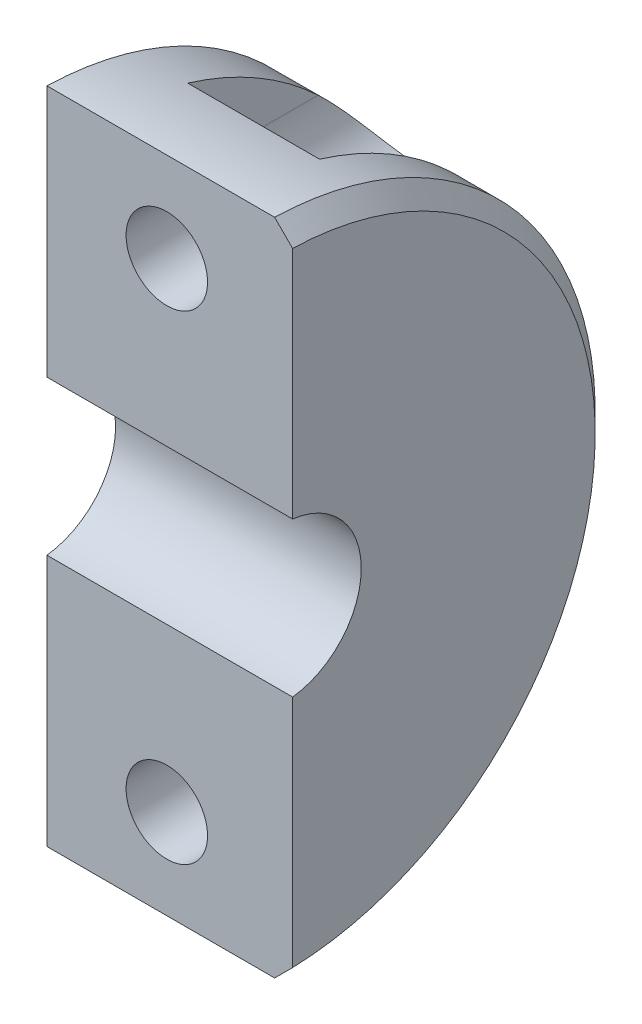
ISO-10303-21;
HEADER;
FILE_DESCRIPTION(('STEP AP214'),'2;1');
FILE_NAME('part.step','',(''),(''),'','','');
FILE_SCHEMA(('AUTOMOTIVE_DESIGN { 1 0 10303 214 1 1 1 1 }'));
ENDSEC;
DATA;
#1=APPLICATION_CONTEXT('core data for automotive mechanical design processes');
#2=APPLICATION_PROTOCOL_DEFINITION('international standard','automotive_design',2000,#1);
#3=PRODUCT_CONTEXT('',#1,'mechanical');
#4=PRODUCT('Part','Part','',(#3));
#5=PRODUCT_RELATED_PRODUCT_CATEGORY('part','',(#4));
#6=PRODUCT_DEFINITION_FORMATION('','',#4);
#7=PRODUCT_DEFINITION_CONTEXT('part definition',#1,'design');
#8=PRODUCT_DEFINITION('design','',#6,#7);
#9=PRODUCT_DEFINITION_SHAPE('','',#8);
#10=(LENGTH_UNIT() NAMED_UNIT(*) SI_UNIT(.MILLI.,.METRE.));
#11=(NAMED_UNIT(*) PLANE_ANGLE_UNIT() SI_UNIT($,.RADIAN.));
#12=(NAMED_UNIT(*) SI_UNIT($,.STERADIAN.) SOLID_ANGLE_UNIT());
#13=UNCERTAINTY_MEASURE_WITH_UNIT(LENGTH_MEASURE(1.E-05),#10,'distance_accuracy_value','');
#14=(GEOMETRIC_REPRESENTATION_CONTEXT(3) GLOBAL_UNCERTAINTY_ASSIGNED_CONTEXT((#13)) GLOBAL_UNIT_ASSIGNED_CONTEXT((#10,
#11,#12)) REPRESENTATION_CONTEXT('',''));
#15=CARTESIAN_POINT('',(0.,0.,0.));
#16=DIRECTION('',(0.,0.,1.));
#17=DIRECTION('',(1.,0.,0.));
#18=AXIS2_PLACEMENT_3D('',#15,#16,#17);
#19=CARTESIAN_POINT('',(46.,0.,0.));
#20=DIRECTION('',(1.,0.,0.));
#21=DIRECTION('',(0.,0.,-1.));
#22=AXIS2_PLACEMENT_3D('',#19,#20,#21);
#23=PLANE('',#22);
#24=DIRECTION('',(0.,1.,0.));
#25=VECTOR('',#24,1.);
#26=CARTESIAN_POINT('',(46.,-16.00282098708,-0.75));
#27=LINE('',#26,#25);
#28=CARTESIAN_POINT('',(46.,6.43343057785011,-0.75));
#29=VERTEX_POINT('',#28);
#30=CARTESIAN_POINT('',(45.9999999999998,25.9891804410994,-0.75));
#31=VERTEX_POINT('',#30);
#32=EDGE_CURVE('E96',#29,#31,#27,.T.);
#33=ORIENTED_EDGE('',*,*,#32,.F.);
#34=CARTESIAN_POINT('',(46.,0.,-1.25373862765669E-11));
#35=DIRECTION('',(-1.,0.,0.));
#36=DIRECTION('',(0.,0.,1.));
#37=AXIS2_PLACEMENT_3D('',#34,#35,#36);
#38=CIRCLE('',#37,6.477);
#39=CARTESIAN_POINT('',(46.,-6.43343057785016,-0.75));
#40=VERTEX_POINT('',#39);
#41=EDGE_CURVE('E19',#29,#40,#38,.T.);
#42=ORIENTED_EDGE('',*,*,#41,.T.);
#43=DIRECTION('',(0.,1.,0.));
#44=VECTOR('',#43,1.);
#45=CARTESIAN_POINT('',(46.,-16.00282098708,-0.75));
#46=LINE('',#45,#44);
#47=CARTESIAN_POINT('',(46.0000000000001,-25.9891804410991,-0.75));
#48=VERTEX_POINT('',#47);
#49=EDGE_CURVE('E125',#48,#40,#46,.T.);
#50=ORIENTED_EDGE('',*,*,#49,.F.);
#51=CARTESIAN_POINT('',(46.0000000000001,0.,0.));
#52=DIRECTION('',(-1.,0.,0.));
#53=DIRECTION('',(0.,0.,1.));
#54=AXIS2_PLACEMENT_3D('',#51,#52,#53);
#55=CIRCLE('',#54,26.0000000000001);
#56=EDGE_CURVE('E100',#31,#48,#55,.T.);
#57=ORIENTED_EDGE('',*,*,#56,.F.);
#58=EDGE_LOOP('',(#33,#42,#50,#57));
#59=FACE_BOUND('',#58,.T.);
#60=ADVANCED_FACE('F16',(#59),#23,.T.);
#61=CARTESIAN_POINT('',(-30.6,0.,-1.091393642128E-11));
#62=DIRECTION('',(-1.,0.,0.));
#63=DIRECTION('',(0.,0.,1.));
#64=AXIS2_PLACEMENT_3D('',#61,#62,#63);
#65=CYLINDRICAL_SURFACE('',#64,6.477);
#66=CARTESIAN_POINT('',(25.5,0.,-1.21029120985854E-11));
#67=DIRECTION('',(-1.,0.,0.));
#68=DIRECTION('',(0.,0.,1.));
#69=AXIS2_PLACEMENT_3D('',#66,#67,#68);
#70=CIRCLE('',#69,6.477);
#71=CARTESIAN_POINT('',(25.5,6.43343057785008,-0.75));
#72=VERTEX_POINT('',#71);
#73=CARTESIAN_POINT('',(25.5,-6.43343057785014,-0.75));
#74=VERTEX_POINT('',#73);
#75=EDGE_CURVE('E212',#72,#74,#70,.T.);
#76=ORIENTED_EDGE('',*,*,#75,.T.);
#77=DIRECTION('',(1.,0.,0.));
#78=VECTOR('',#77,1.);
#79=CARTESIAN_POINT('',(63.49656956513,-6.43343057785,-0.75));
#80=LINE('',#79,#78);
#81=EDGE_CURVE('E110',#40,#74,#80,.F.);
#82=ORIENTED_EDGE('',*,*,#81,.F.);
#83=ORIENTED_EDGE('',*,*,#41,.F.);
#84=DIRECTION('',(1.,0.,0.));
#85=VECTOR('',#84,1.);
#86=CARTESIAN_POINT('',(63.49656956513,6.43343057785,-0.75));
#87=LINE('',#86,#85);
#88=EDGE_CURVE('E104',#72,#29,#87,.T.);
#89=ORIENTED_EDGE('',*,*,#88,.F.);
#90=EDGE_LOOP('',(#76,#82,#83,#89));
#91=FACE_BOUND('',#90,.T.);
#92=ADVANCED_FACE('F107',(#91),#65,.F.);
#93=CARTESIAN_POINT('',(35.5,20.,8.866652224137));
#94=DIRECTION('',(0.,0.,-1.));
#95=DIRECTION('',(-1.,0.,0.));
#96=AXIS2_PLACEMENT_3D('',#93,#94,#95);
#97=CYLINDRICAL_SURFACE('',#96,3.4);
#98=CARTESIAN_POINT('',(35.5,20.,-8.));
#99=DIRECTION('',(0.,0.,-1.));
#100=DIRECTION('',(-1.,0.,0.));
#101=AXIS2_PLACEMENT_3D('',#98,#99,#100);
#102=CIRCLE('',#101,3.4);
#103=CARTESIAN_POINT('',(32.1,20.,-8.));
#104=VERTEX_POINT('',#103);
#105=EDGE_CURVE('E200',#104,#104,#102,.T.);
#106=ORIENTED_EDGE('',*,*,#105,.T.);
#107=EDGE_LOOP('',(#106));
#108=FACE_BOUND('',#107,.T.);
#109=CARTESIAN_POINT('',(35.5,20.,-0.750000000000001));
#110=DIRECTION('',(0.,0.,-1.));
#111=DIRECTION('',(-1.,0.,0.));
#112=AXIS2_PLACEMENT_3D('',#109,#110,#111);
#113=CIRCLE('',#112,3.4);
#114=CARTESIAN_POINT('',(32.1,20.,-0.750000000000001));
#115=VERTEX_POINT('',#114);
#116=EDGE_CURVE('E116',#115,#115,#113,.T.);
#117=ORIENTED_EDGE('',*,*,#116,.F.);
#118=EDGE_LOOP('',(#117));
#119=FACE_BOUND('',#118,.T.);
#120=ADVANCED_FACE('F263',(#108,#119),#97,.F.);
#121=CARTESIAN_POINT('',(35.5,-20.,8.866652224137));
#122=DIRECTION('',(0.,0.,-1.));
#123=DIRECTION('',(-1.,0.,0.));
#124=AXIS2_PLACEMENT_3D('',#121,#122,#123);
#125=CYLINDRICAL_SURFACE('',#124,3.4);
#126=CARTESIAN_POINT('',(35.5,-20.,-8.));
#127=DIRECTION('',(0.,0.,-1.));
#128=DIRECTION('',(-1.,0.,0.));
#129=AXIS2_PLACEMENT_3D('',#126,#127,#128);
#130=CIRCLE('',#129,3.4);
#131=CARTESIAN_POINT('',(32.1,-20.,-8.));
#132=VERTEX_POINT('',#131);
#133=EDGE_CURVE('E186',#132,#132,#130,.T.);
#134=ORIENTED_EDGE('',*,*,#133,.T.);
#135=EDGE_LOOP('',(#134));
#136=FACE_BOUND('',#135,.T.);
#137=CARTESIAN_POINT('',(35.5,-20.,-0.750000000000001));
#138=DIRECTION('',(0.,0.,-1.));
#139=DIRECTION('',(-1.,0.,0.));
#140=AXIS2_PLACEMENT_3D('',#137,#138,#139);
#141=CIRCLE('',#140,3.4);
#142=CARTESIAN_POINT('',(32.1,-20.,-0.750000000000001));
#143=VERTEX_POINT('',#142);
#144=EDGE_CURVE('E124',#143,#143,#141,.T.);
#145=ORIENTED_EDGE('',*,*,#144,.F.);
#146=EDGE_LOOP('',(#145));
#147=FACE_BOUND('',#146,.T.);
#148=ADVANCED_FACE('F259',(#136,#147),#125,.F.);
#149=CARTESIAN_POINT('',(63.49656956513,-16.00282098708,-0.75));
#150=DIRECTION('',(0.,0.,1.));
#151=DIRECTION('',(1.,0.,0.));
#152=AXIS2_PLACEMENT_3D('',#149,#150,#151);
#153=PLANE('',#152);
#154=ORIENTED_EDGE('',*,*,#116,.T.);
#155=EDGE_LOOP('',(#154));
#156=FACE_BOUND('',#155,.T.);
#157=DIRECTION('',(0.,1.,0.));
#158=VECTOR('',#157,1.);
#159=CARTESIAN_POINT('',(25.5,-30.70596061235,-0.75));
#160=LINE('',#159,#158);
#161=CARTESIAN_POINT('',(25.5,27.4897708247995,-0.749999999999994));
#162=VERTEX_POINT('',#161);
#163=EDGE_CURVE('E114',#162,#72,#160,.F.);
#164=ORIENTED_EDGE('',*,*,#163,.T.);
#165=ORIENTED_EDGE('',*,*,#88,.T.);
#166=ORIENTED_EDGE('',*,*,#32,.T.);
#167=CARTESIAN_POINT('',(44.4999999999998,27.4897708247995,-0.75));
#168=CARTESIAN_POINT('',(44.7500027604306,27.2396751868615,-0.75));
#169=CARTESIAN_POINT('',(45.0000041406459,26.9895781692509,-0.75));
#170=CARTESIAN_POINT('',(45.5000041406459,26.4893813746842,-0.75));
#171=CARTESIAN_POINT('',(45.7500027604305,26.2392815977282,-0.75));
#172=CARTESIAN_POINT('',(45.9999999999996,25.9891804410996,-0.75));
#173=B_SPLINE_CURVE_WITH_KNOTS('',3,(#167,#168,#169,#170,#171,#172),.UNSPECIFIED.,.F.,.F.,(4,2,
4),(0.,1.06086892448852,2.12173784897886),.UNSPECIFIED.);
#174=CARTESIAN_POINT('',(44.4999999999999,27.4897708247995,-0.749999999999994));
#175=VERTEX_POINT('',#174);
#176=EDGE_CURVE('E222',#175,#31,#173,.T.);
#177=ORIENTED_EDGE('',*,*,#176,.F.);
#178=DIRECTION('',(-1.,0.,0.));
#179=VECTOR('',#178,1.);
#180=CARTESIAN_POINT('',(46.,27.4897708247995,-0.749999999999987));
#181=LINE('',#180,#179);
#182=EDGE_CURVE('E121',#162,#175,#181,.F.);
#183=ORIENTED_EDGE('',*,*,#182,.F.);
#184=EDGE_LOOP('',(#164,#165,#166,#177,#183));
#185=FACE_BOUND('',#184,.T.);
#186=ADVANCED_FACE('F112',(#156,#185),#153,.T.);
#187=CARTESIAN_POINT('',(44.4999999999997,0.,0.));
#188=DIRECTION('',(-1.,0.,0.));
#189=DIRECTION('',(0.,0.,1.));
#190=AXIS2_PLACEMENT_3D('',#187,#188,#189);
#191=CONICAL_SURFACE('',#190,27.5000000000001,0.785398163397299);
#192=CARTESIAN_POINT('',(44.5,0.,0.));
#193=DIRECTION('',(-1.,0.,0.));
#194=DIRECTION('',(0.,0.,1.));
#195=AXIS2_PLACEMENT_3D('',#192,#193,#194);
#196=CIRCLE('',#195,27.5);
#197=CARTESIAN_POINT('',(44.4999999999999,-27.4897708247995,-0.749999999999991));
#198=VERTEX_POINT('',#197);
#199=EDGE_CURVE('E216',#175,#198,#196,.T.);
#200=ORIENTED_EDGE('',*,*,#199,.F.);
#201=ORIENTED_EDGE('',*,*,#176,.T.);
#202=ORIENTED_EDGE('',*,*,#56,.T.);
#203=CARTESIAN_POINT('',(44.4999999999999,-27.4897708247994,-0.75));
#204=CARTESIAN_POINT('',(44.7500027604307,-27.2396751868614,-0.75));
#205=CARTESIAN_POINT('',(45.000004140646,-26.9895781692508,-0.75));
#206=CARTESIAN_POINT('',(45.500004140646,-26.4893813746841,-0.75));
#207=CARTESIAN_POINT('',(45.7500027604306,-26.2392815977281,-0.75));
#208=CARTESIAN_POINT('',(45.9999999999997,-25.9891804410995,-0.75));
#209=B_SPLINE_CURVE_WITH_KNOTS('',3,(#203,#204,#205,#206,#207,#208),.UNSPECIFIED.,.F.,.F.,(4,2,
4),(0.,1.06086892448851,2.12173784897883),.UNSPECIFIED.);
#210=EDGE_CURVE('E126',#198,#48,#209,.T.);
#211=ORIENTED_EDGE('',*,*,#210,.F.);
#212=EDGE_LOOP('',(#200,#201,#202,#211));
#213=FACE_BOUND('',#212,.T.);
#214=ADVANCED_FACE('F225',(#213),#191,.T.);
#215=CARTESIAN_POINT('',(63.49656956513,-16.00282098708,-0.75));
#216=DIRECTION('',(0.,0.,1.));
#217=DIRECTION('',(1.,0.,0.));
#218=AXIS2_PLACEMENT_3D('',#215,#216,#217);
#219=PLANE('',#218);
#220=ORIENTED_EDGE('',*,*,#144,.T.);
#221=EDGE_LOOP('',(#220));
#222=FACE_BOUND('',#221,.T.);
#223=ORIENTED_EDGE('',*,*,#49,.T.);
#224=ORIENTED_EDGE('',*,*,#81,.T.);
#225=DIRECTION('',(0.,1.,0.));
#226=VECTOR('',#225,1.);
#227=CARTESIAN_POINT('',(25.5,-30.70596061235,-0.75));
#228=LINE('',#227,#226);
#229=CARTESIAN_POINT('',(25.5,-27.4897708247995,-0.749999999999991));
#230=VERTEX_POINT('',#229);
#231=EDGE_CURVE('E209',#74,#230,#228,.F.);
#232=ORIENTED_EDGE('',*,*,#231,.T.);
#233=DIRECTION('',(-1.,0.,0.));
#234=VECTOR('',#233,1.);
#235=CARTESIAN_POINT('',(46.,-27.4897708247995,-0.749999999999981));
#236=LINE('',#235,#234);
#237=EDGE_CURVE('E213',#198,#230,#236,.T.);
#238=ORIENTED_EDGE('',*,*,#237,.F.);
#239=ORIENTED_EDGE('',*,*,#210,.T.);
#240=EDGE_LOOP('',(#223,#224,#232,#238,#239));
#241=FACE_BOUND('',#240,.T.);
#242=ADVANCED_FACE('F230',(#222,#241),#219,.T.);
#243=CARTESIAN_POINT('',(25.5,-30.70596061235,0.));
#244=DIRECTION('',(1.,0.,0.));
#245=DIRECTION('',(0.,0.,-1.));
#246=AXIS2_PLACEMENT_3D('',#243,#244,#245);
#247=PLANE('',#246);
#248=CARTESIAN_POINT('',(25.5,0.,0.));
#249=DIRECTION('',(-1.,0.,0.));
#250=DIRECTION('',(0.,0.,1.));
#251=AXIS2_PLACEMENT_3D('',#248,#249,#250);
#252=CIRCLE('',#251,27.5);
#253=EDGE_CURVE('E182',#230,#162,#252,.F.);
#254=ORIENTED_EDGE('',*,*,#253,.F.);
#255=ORIENTED_EDGE('',*,*,#231,.F.);
#256=ORIENTED_EDGE('',*,*,#75,.F.);
#257=ORIENTED_EDGE('',*,*,#163,.F.);
#258=EDGE_LOOP('',(#254,#255,#256,#257));
#259=FACE_BOUND('',#258,.T.);
#260=ADVANCED_FACE('F233',(#259),#247,.F.);
#261=CARTESIAN_POINT('',(41.,26.52133436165,-27.5));
#262=DIRECTION('',(1.,0.,0.));
#263=DIRECTION('',(0.,0.,-1.));
#264=AXIS2_PLACEMENT_3D('',#261,#262,#263);
#265=PLANE('',#264);
#266=DIRECTION('',(0.,0.,1.));
#267=VECTOR('',#266,1.);
#268=CARTESIAN_POINT('',(41.,20.,-27.5));
#269=LINE('',#268,#267);
#270=CARTESIAN_POINT('',(41.,20.,-18.8745860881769));
#271=VERTEX_POINT('',#270);
#272=CARTESIAN_POINT('',(41.,20.,-8.));
#273=VERTEX_POINT('',#272);
#274=EDGE_CURVE('E196',#271,#273,#269,.T.);
#275=ORIENTED_EDGE('',*,*,#274,.T.);
#276=DIRECTION('',(0.,1.,0.));
#277=VECTOR('',#276,1.);
#278=CARTESIAN_POINT('',(41.,20.,-8.));
#279=LINE('',#278,#277);
#280=CARTESIAN_POINT('',(41.,26.3106442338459,-7.99999999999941));
#281=VERTEX_POINT('',#280);
#282=EDGE_CURVE('E206',#273,#281,#279,.T.);
#283=ORIENTED_EDGE('',*,*,#282,.T.);
#284=CARTESIAN_POINT('',(41.,0.,0.));
#285=DIRECTION('',(-1.,0.,0.));
#286=DIRECTION('',(0.,0.,1.));
#287=AXIS2_PLACEMENT_3D('',#284,#285,#286);
#288=CIRCLE('',#287,27.5);
#289=EDGE_CURVE('E205',#271,#281,#288,.F.);
#290=ORIENTED_EDGE('',*,*,#289,.F.);
#291=EDGE_LOOP('',(#275,#283,#290));
#292=FACE_BOUND('',#291,.T.);
#293=ADVANCED_FACE('F323',(#292),#265,.F.);
#294=CARTESIAN_POINT('',(35.5,20.,-8.));
#295=DIRECTION('',(0.,0.,1.));
#296=DIRECTION('',(1.,0.,0.));
#297=AXIS2_PLACEMENT_3D('',#294,#295,#296);
#298=PLANE('',#297);
#299=ORIENTED_EDGE('',*,*,#105,.F.);
#300=EDGE_LOOP('',(#299));
#301=FACE_BOUND('',#300,.T.);
#302=ORIENTED_EDGE('',*,*,#282,.F.);
#303=CARTESIAN_POINT('',(35.5,20.,-8.));
#304=DIRECTION('',(0.,0.,1.));
#305=DIRECTION('',(1.,0.,0.));
#306=AXIS2_PLACEMENT_3D('',#303,#304,#305);
#307=CIRCLE('',#306,5.5);
#308=CARTESIAN_POINT('',(30.,20.,-8.));
#309=VERTEX_POINT('',#308);
#310=EDGE_CURVE('E195',#273,#309,#307,.F.);
#311=ORIENTED_EDGE('',*,*,#310,.T.);
#312=DIRECTION('',(0.,1.,0.));
#313=VECTOR('',#312,1.);
#314=CARTESIAN_POINT('',(30.,20.,-8.));
#315=LINE('',#314,#313);
#316=CARTESIAN_POINT('',(30.,26.3106442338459,-7.99999999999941));
#317=VERTEX_POINT('',#316);
#318=EDGE_CURVE('E198',#309,#317,#315,.T.);
#319=ORIENTED_EDGE('',*,*,#318,.T.);
#320=DIRECTION('',(-1.,0.,0.));
#321=VECTOR('',#320,1.);
#322=CARTESIAN_POINT('',(46.,26.3106442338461,-7.99999999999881));
#323=LINE('',#322,#321);
#324=EDGE_CURVE('E201',#281,#317,#323,.T.);
#325=ORIENTED_EDGE('',*,*,#324,.F.);
#326=EDGE_LOOP('',(#302,#311,#319,#325));
#327=FACE_BOUND('',#326,.T.);
#328=ADVANCED_FACE('F331',(#301,#327),#298,.F.);
#329=CARTESIAN_POINT('',(30.,20.,-27.5));
#330=DIRECTION('',(-1.,0.,0.));
#331=DIRECTION('',(0.,0.,1.));
#332=AXIS2_PLACEMENT_3D('',#329,#330,#331);
#333=PLANE('',#332);
#334=ORIENTED_EDGE('',*,*,#318,.F.);
#335=DIRECTION('',(0.,0.,1.));
#336=VECTOR('',#335,1.);
#337=CARTESIAN_POINT('',(30.,20.,-27.5));
#338=LINE('',#337,#336);
#339=CARTESIAN_POINT('',(30.,19.9999999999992,-18.8745860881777));
#340=VERTEX_POINT('',#339);
#341=EDGE_CURVE('E193',#309,#340,#338,.F.);
#342=ORIENTED_EDGE('',*,*,#341,.T.);
#343=CARTESIAN_POINT('',(30.,0.,0.));
#344=DIRECTION('',(-1.,0.,0.));
#345=DIRECTION('',(0.,0.,1.));
#346=AXIS2_PLACEMENT_3D('',#343,#344,#345);
#347=CIRCLE('',#346,27.5);
#348=EDGE_CURVE('E204',#317,#340,#347,.T.);
#349=ORIENTED_EDGE('',*,*,#348,.F.);
#350=EDGE_LOOP('',(#334,#342,#349));
#351=FACE_BOUND('',#350,.T.);
#352=ADVANCED_FACE('F341',(#351),#333,.F.);
#353=CARTESIAN_POINT('',(35.5,20.,-27.5));
#354=DIRECTION('',(0.,0.,1.));
#355=DIRECTION('',(1.,0.,0.));
#356=AXIS2_PLACEMENT_3D('',#353,#354,#355);
#357=CYLINDRICAL_SURFACE('',#356,5.5);
#358=ORIENTED_EDGE('',*,*,#341,.F.);
#359=ORIENTED_EDGE('',*,*,#310,.F.);
#360=ORIENTED_EDGE('',*,*,#274,.F.);
#361=CARTESIAN_POINT('',(30.,19.9999999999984,-18.8745860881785));
#362=CARTESIAN_POINT('',(30.0000150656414,19.8413978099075,-19.042674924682));
#363=CARTESIAN_POINT('',(30.0068638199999,19.6805873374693,-19.2088004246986));
#364=CARTESIAN_POINT('',(30.0354704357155,19.3552748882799,-19.5365407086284));
#365=CARTESIAN_POINT('',(30.0572499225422,19.1907678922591,-19.69814859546));
#366=CARTESIAN_POINT('',(30.1172335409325,18.8577727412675,-20.0171955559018));
#367=CARTESIAN_POINT('',(30.1555826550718,18.6892621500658,-20.1745844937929));
#368=CARTESIAN_POINT('',(30.2500369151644,18.3511596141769,-20.4826062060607));
#369=CARTESIAN_POINT('',(30.3061317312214,18.1815683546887,-20.6332428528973));
#370=CARTESIAN_POINT('',(30.4242933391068,17.8767140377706,-20.8974956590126));
#371=CARTESIAN_POINT('',(30.4829476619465,17.7413387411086,-21.0125113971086));
#372=CARTESIAN_POINT('',(30.6130720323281,17.4720994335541,-21.2369119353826));
#373=CARTESIAN_POINT('',(30.6845394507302,17.3382351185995,-21.3462978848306));
#374=CARTESIAN_POINT('',(30.8405503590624,17.0737350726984,-21.5584373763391));
#375=CARTESIAN_POINT('',(30.9250502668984,16.9430902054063,-21.6612114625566));
#376=CARTESIAN_POINT('',(31.1076472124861,16.6860789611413,-21.859806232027));
#377=CARTESIAN_POINT('',(31.2057418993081,16.5597118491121,-21.9556281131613));
#378=CARTESIAN_POINT('',(31.3989964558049,16.3325288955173,-22.1249922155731));
#379=CARTESIAN_POINT('',(31.4921505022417,16.2308412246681,-22.1996565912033));
#380=CARTESIAN_POINT('',(31.6881069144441,16.032775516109,-22.3431209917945));
#381=CARTESIAN_POINT('',(31.7909075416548,15.9363965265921,-22.4119220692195));
#382=CARTESIAN_POINT('',(32.0060331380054,15.7500039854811,-22.5433003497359));
#383=CARTESIAN_POINT('',(32.1183658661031,15.6599957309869,-22.6058723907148));
#384=CARTESIAN_POINT('',(32.3520162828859,15.4876548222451,-22.7242926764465));
#385=CARTESIAN_POINT('',(32.4733294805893,15.4053183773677,-22.7801442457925));
#386=CARTESIAN_POINT('',(32.725208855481,15.2489316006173,-22.8851265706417));
#387=CARTESIAN_POINT('',(32.8558306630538,15.1749393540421,-22.9342106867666));
#388=CARTESIAN_POINT('',(33.1247195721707,15.0370514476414,-23.0248538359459));
#389=CARTESIAN_POINT('',(33.2629831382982,14.9731511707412,-23.066416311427));
#390=CARTESIAN_POINT('',(33.5461376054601,14.8564736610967,-23.141737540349));
#391=CARTESIAN_POINT('',(33.6910268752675,14.8036937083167,-23.1754982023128));
#392=CARTESIAN_POINT('',(33.9862303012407,14.7101544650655,-23.234983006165));
#393=CARTESIAN_POINT('',(34.136543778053,14.6693936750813,-23.2607081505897));
#394=CARTESIAN_POINT('',(34.4239524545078,14.6045104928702,-23.3014927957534));
#395=CARTESIAN_POINT('',(34.5606179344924,14.5790269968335,-23.3174299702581));
#396=CARTESIAN_POINT('',(34.8360778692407,14.5384450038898,-23.3427546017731));
#397=CARTESIAN_POINT('',(34.9748721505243,14.5233456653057,-23.3521425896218));
#398=CARTESIAN_POINT('',(35.2534475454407,14.503755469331,-23.3643148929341));
#399=CARTESIAN_POINT('',(35.3932283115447,14.4992610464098,-23.3671014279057));
#400=CARTESIAN_POINT('',(35.6727009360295,14.5009365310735,-23.3660617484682));
#401=CARTESIAN_POINT('',(35.8123927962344,14.507106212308,-23.3622356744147));
#402=CARTESIAN_POINT('',(36.0827907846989,14.5293767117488,-23.3483911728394));
#403=CARTESIAN_POINT('',(36.2135630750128,14.5449036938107,-23.3387304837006));
#404=CARTESIAN_POINT('',(36.4731541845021,14.5851843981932,-23.313578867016));
#405=CARTESIAN_POINT('',(36.6019723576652,14.6099411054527,-23.2980860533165));
#406=CARTESIAN_POINT('',(36.8566734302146,14.668349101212,-23.2613568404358));
#407=CARTESIAN_POINT('',(36.9825576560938,14.7019962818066,-23.2401230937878));
#408=CARTESIAN_POINT('',(37.2306848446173,14.7777816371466,-23.192006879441));
#409=CARTESIAN_POINT('',(37.3529264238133,14.8199229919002,-23.1651222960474));
#410=CARTESIAN_POINT('',(37.5946259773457,14.9128070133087,-23.1054381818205));
#411=CARTESIAN_POINT('',(37.714022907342,14.963659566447,-23.0725626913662));
#412=CARTESIAN_POINT('',(37.9476319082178,15.0729587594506,-23.0013079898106));
#413=CARTESIAN_POINT('',(38.0618420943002,15.1314081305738,-22.9629267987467));
#414=CARTESIAN_POINT('',(38.2844427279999,15.2552033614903,-22.8808714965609));
#415=CARTESIAN_POINT('',(38.3928341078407,15.3205481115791,-22.8371982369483));
#416=CARTESIAN_POINT('',(38.6033889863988,15.457450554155,-22.7447586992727));
#417=CARTESIAN_POINT('',(38.7055501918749,15.5290105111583,-22.6959905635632));
#418=CARTESIAN_POINT('',(38.9108255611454,15.6832901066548,-22.5896841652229));
#419=CARTESIAN_POINT('',(39.0134137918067,15.7664446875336,-22.5317603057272));
#420=CARTESIAN_POINT('',(39.2106288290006,15.9381826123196,-22.4106095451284));
#421=CARTESIAN_POINT('',(39.3052523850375,16.026768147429,-22.3473804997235));
#422=CARTESIAN_POINT('',(39.5768121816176,16.2992913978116,-22.1502392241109));
#423=CARTESIAN_POINT('',(39.7415979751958,16.4901184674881,-22.0087892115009));
#424=CARTESIAN_POINT('',(39.9935135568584,16.8238343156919,-21.7540481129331));
#425=CARTESIAN_POINT('',(40.0890863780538,16.9638582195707,-21.6451011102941));
#426=CARTESIAN_POINT('',(40.2646993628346,17.2476452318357,-21.4196528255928));
#427=CARTESIAN_POINT('',(40.3447341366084,17.3914096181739,-21.3031489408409));
#428=CARTESIAN_POINT('',(40.4900196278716,17.6813580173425,-21.0631226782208));
#429=CARTESIAN_POINT('',(40.5552228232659,17.8275482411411,-20.9395792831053));
#430=CARTESIAN_POINT('',(40.6712998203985,18.1205096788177,-20.6865799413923));
#431=CARTESIAN_POINT('',(40.7221716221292,18.267280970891,-20.5571231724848));
#432=CARTESIAN_POINT('',(40.8071353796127,18.5493526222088,-20.3028291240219));
#433=CARTESIAN_POINT('',(40.8421908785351,18.6846976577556,-20.1783595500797));
#434=CARTESIAN_POINT('',(40.901402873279,18.9541176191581,-19.925500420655));
#435=CARTESIAN_POINT('',(40.9255581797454,19.0881924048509,-19.7971104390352));
#436=CARTESIAN_POINT('',(40.9634774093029,19.3533131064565,-19.537996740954));
#437=CARTESIAN_POINT('',(40.9773268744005,19.4843750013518,-19.4073016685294));
#438=CARTESIAN_POINT('',(40.9955822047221,19.744089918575,-19.1430231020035));
#439=CARTESIAN_POINT('',(40.9999930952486,19.8727441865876,-19.0094411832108));
#440=CARTESIAN_POINT('',(41.,19.9999999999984,-18.8745860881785));
#441=B_SPLINE_CURVE_WITH_KNOTS('',3,(#361,#362,#363,#364,#365,#366,#367,#368,#369,#370,#371,
#372,#373,#374,#375,#376,#377,#378,#379,#380,#381,#382,#383,#384,#385,#386,#387,#388,#389,#390,
#391,#392,#393,#394,#395,#396,#397,#398,#399,#400,#401,#402,#403,#404,#405,#406,#407,#408,#409,
#410,#411,#412,#413,#414,#415,#416,#417,#418,#419,#420,#421,#422,#423,#424,#425,#426,#427,#428,
#429,#430,#431,#432,#433,#434,#435,#436,#437,#438,#439,#440),.UNSPECIFIED.,.F.,.F.,(4,2,2,2,2,2,
2,2,2,2,2,2,2,2,2,2,2,2,2,2,2,2,2,2,2,2,2,2,2,2,2,2,2,2,2,2,2,2,2,4),(0.,0.693321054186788,
1.38764843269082,2.08817820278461,2.78830093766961,3.34903406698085,3.9096522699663,
4.46843480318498,5.0271208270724,5.49712364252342,5.96704191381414,6.43734642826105,
6.90741731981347,7.38058116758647,7.85352791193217,8.32635883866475,8.79913074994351,
9.21838770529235,9.63761067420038,10.0566926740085,10.4757657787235,10.8714361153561,
11.2672345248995,11.6628503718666,12.0586146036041,12.459798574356,12.8611271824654,
13.2623913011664,13.6638022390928,14.0959473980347,14.5282680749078,15.3922599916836,
15.9961235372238,16.6001961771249,17.2061778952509,17.8122441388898,18.3734347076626,
18.9346864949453,19.4912260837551,20.0474692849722),.UNSPECIFIED.);
#442=EDGE_CURVE('E140',#340,#271,#441,.T.);
#443=ORIENTED_EDGE('',*,*,#442,.F.);
#444=EDGE_LOOP('',(#358,#359,#360,#443));
#445=FACE_BOUND('',#444,.T.);
#446=ADVANCED_FACE('F170',(#445),#357,.F.);
#447=CARTESIAN_POINT('',(35.5,-20.,-27.5));
#448=DIRECTION('',(0.,0.,1.));
#449=DIRECTION('',(1.,0.,0.));
#450=AXIS2_PLACEMENT_3D('',#447,#448,#449);
#451=CYLINDRICAL_SURFACE('',#450,5.5);
#452=DIRECTION('',(0.,0.,1.));
#453=VECTOR('',#452,1.);
#454=CARTESIAN_POINT('',(30.,-20.,-27.5));
#455=LINE('',#454,#453);
#456=CARTESIAN_POINT('',(30.,-20.,-8.));
#457=VERTEX_POINT('',#456);
#458=CARTESIAN_POINT('',(30.,-20.,-18.8745860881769));
#459=VERTEX_POINT('',#458);
#460=EDGE_CURVE('E173',#457,#459,#455,.F.);
#461=ORIENTED_EDGE('',*,*,#460,.T.);
#462=CARTESIAN_POINT('',(41.,-19.9999999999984,-18.8745860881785));
#463=CARTESIAN_POINT('',(40.9999849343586,-19.8413978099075,-19.042674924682));
#464=CARTESIAN_POINT('',(40.9931361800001,-19.6805873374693,-19.2088004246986));
#465=CARTESIAN_POINT('',(40.9645295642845,-19.3552748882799,-19.5365407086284));
#466=CARTESIAN_POINT('',(40.9427500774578,-19.1907678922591,-19.69814859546));
#467=CARTESIAN_POINT('',(40.8827664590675,-18.8577727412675,-20.0171955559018));
#468=CARTESIAN_POINT('',(40.8444173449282,-18.6892621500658,-20.1745844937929));
#469=CARTESIAN_POINT('',(40.7499630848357,-18.3511596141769,-20.4826062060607));
#470=CARTESIAN_POINT('',(40.6938682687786,-18.1815683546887,-20.6332428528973));
#471=CARTESIAN_POINT('',(40.5757066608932,-17.8767140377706,-20.8974956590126));
#472=CARTESIAN_POINT('',(40.5170523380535,-17.7413387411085,-21.0125113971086));
#473=CARTESIAN_POINT('',(40.386927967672,-17.4720994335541,-21.2369119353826));
#474=CARTESIAN_POINT('',(40.3154605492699,-17.3382351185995,-21.3462978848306));
#475=CARTESIAN_POINT('',(40.1594496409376,-17.0737350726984,-21.5584373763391));
#476=CARTESIAN_POINT('',(40.0749497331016,-16.9430902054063,-21.6612114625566));
#477=CARTESIAN_POINT('',(39.8923527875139,-16.6860789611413,-21.859806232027));
#478=CARTESIAN_POINT('',(39.7942581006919,-16.5597118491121,-21.9556281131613));
#479=CARTESIAN_POINT('',(39.6010035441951,-16.3325288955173,-22.1249922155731));
#480=CARTESIAN_POINT('',(39.5078494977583,-16.2308412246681,-22.1996565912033));
#481=CARTESIAN_POINT('',(39.3118930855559,-16.032775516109,-22.3431209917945));
#482=CARTESIAN_POINT('',(39.2090924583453,-15.9363965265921,-22.4119220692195));
#483=CARTESIAN_POINT('',(38.9939668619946,-15.7500039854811,-22.5433003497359));
#484=CARTESIAN_POINT('',(38.8816341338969,-15.6599957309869,-22.6058723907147));
#485=CARTESIAN_POINT('',(38.6479837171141,-15.4876548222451,-22.7242926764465));
#486=CARTESIAN_POINT('',(38.5266705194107,-15.4053183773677,-22.7801442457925));
#487=CARTESIAN_POINT('',(38.274791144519,-15.2489316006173,-22.8851265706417));
#488=CARTESIAN_POINT('',(38.1441693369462,-15.1749393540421,-22.9342106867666));
#489=CARTESIAN_POINT('',(37.8752804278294,-15.0370514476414,-23.0248538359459));
#490=CARTESIAN_POINT('',(37.7370168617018,-14.9731511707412,-23.066416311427));
#491=CARTESIAN_POINT('',(37.4538623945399,-14.8564736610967,-23.141737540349));
#492=CARTESIAN_POINT('',(37.3089731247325,-14.8036937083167,-23.1754982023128));
#493=CARTESIAN_POINT('',(37.0137696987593,-14.7101544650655,-23.234983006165));
#494=CARTESIAN_POINT('',(36.8634562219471,-14.6693936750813,-23.2607081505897));
#495=CARTESIAN_POINT('',(36.5760475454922,-14.6045104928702,-23.3014927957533));
#496=CARTESIAN_POINT('',(36.4393820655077,-14.5790269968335,-23.3174299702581));
#497=CARTESIAN_POINT('',(36.1639221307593,-14.5384450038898,-23.3427546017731));
#498=CARTESIAN_POINT('',(36.0251278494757,-14.5233456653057,-23.3521425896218));
#499=CARTESIAN_POINT('',(35.7465524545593,-14.503755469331,-23.3643148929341));
#500=CARTESIAN_POINT('',(35.6067716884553,-14.4992610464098,-23.3671014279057));
#501=CARTESIAN_POINT('',(35.3272990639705,-14.5009365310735,-23.3660617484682));
#502=CARTESIAN_POINT('',(35.1876072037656,-14.507106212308,-23.3622356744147));
#503=CARTESIAN_POINT('',(34.9172092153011,-14.5293767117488,-23.3483911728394));
#504=CARTESIAN_POINT('',(34.7864369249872,-14.5449036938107,-23.3387304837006));
#505=CARTESIAN_POINT('',(34.5268458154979,-14.5851843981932,-23.313578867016));
#506=CARTESIAN_POINT('',(34.3980276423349,-14.6099411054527,-23.2980860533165));
#507=CARTESIAN_POINT('',(34.1433265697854,-14.668349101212,-23.2613568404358));
#508=CARTESIAN_POINT('',(34.0174423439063,-14.7019962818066,-23.2401230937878));
#509=CARTESIAN_POINT('',(33.7693151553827,-14.7777816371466,-23.192006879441));
#510=CARTESIAN_POINT('',(33.6470735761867,-14.8199229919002,-23.1651222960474));
#511=CARTESIAN_POINT('',(33.4053740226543,-14.9128070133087,-23.1054381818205));
#512=CARTESIAN_POINT('',(33.285977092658,-14.963659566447,-23.0725626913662));
#513=CARTESIAN_POINT('',(33.0523680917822,-15.0729587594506,-23.0013079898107));
#514=CARTESIAN_POINT('',(32.9381579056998,-15.1314081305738,-22.9629267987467));
#515=CARTESIAN_POINT('',(32.7155572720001,-15.2552033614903,-22.8808714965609));
#516=CARTESIAN_POINT('',(32.6071658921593,-15.3205481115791,-22.8371982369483));
#517=CARTESIAN_POINT('',(32.3966110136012,-15.457450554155,-22.7447586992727));
#518=CARTESIAN_POINT('',(32.2944498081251,-15.5290105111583,-22.6959905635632));
#519=CARTESIAN_POINT('',(32.0891744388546,-15.6832901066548,-22.5896841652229));
#520=CARTESIAN_POINT('',(31.9865862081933,-15.7664446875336,-22.5317603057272));
#521=CARTESIAN_POINT('',(31.7893711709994,-15.9381826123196,-22.4106095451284));
#522=CARTESIAN_POINT('',(31.6947476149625,-16.026768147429,-22.3473804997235));
#523=CARTESIAN_POINT('',(31.4231878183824,-16.2992913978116,-22.1502392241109));
#524=CARTESIAN_POINT('',(31.2584020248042,-16.4901184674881,-22.0087892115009));
#525=CARTESIAN_POINT('',(31.0064864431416,-16.8238343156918,-21.7540481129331));
#526=CARTESIAN_POINT('',(30.9109136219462,-16.9638582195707,-21.6451011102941));
#527=CARTESIAN_POINT('',(30.7353006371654,-17.2476452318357,-21.4196528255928));
#528=CARTESIAN_POINT('',(30.6552658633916,-17.3914096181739,-21.3031489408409));
#529=CARTESIAN_POINT('',(30.5099803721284,-17.6813580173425,-21.0631226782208));
#530=CARTESIAN_POINT('',(30.4447771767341,-17.8275482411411,-20.9395792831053));
#531=CARTESIAN_POINT('',(30.3287001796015,-18.1205096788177,-20.6865799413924));
#532=CARTESIAN_POINT('',(30.2778283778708,-18.267280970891,-20.5571231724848));
#533=CARTESIAN_POINT('',(30.1928646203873,-18.5493526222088,-20.3028291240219));
#534=CARTESIAN_POINT('',(30.1578091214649,-18.6846976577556,-20.1783595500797));
#535=CARTESIAN_POINT('',(30.098597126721,-18.9541176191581,-19.925500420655));
#536=CARTESIAN_POINT('',(30.0744418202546,-19.0881924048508,-19.7971104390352));
#537=CARTESIAN_POINT('',(30.0365225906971,-19.3533131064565,-19.537996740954));
#538=CARTESIAN_POINT('',(30.0226731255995,-19.4843750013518,-19.4073016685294));
#539=CARTESIAN_POINT('',(30.0044177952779,-19.744089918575,-19.1430231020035));
#540=CARTESIAN_POINT('',(30.0000069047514,-19.8727441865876,-19.0094411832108));
#541=CARTESIAN_POINT('',(30.,-19.9999999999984,-18.8745860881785));
#542=B_SPLINE_CURVE_WITH_KNOTS('',3,(#462,#463,#464,#465,#466,#467,#468,#469,#470,#471,#472,
#473,#474,#475,#476,#477,#478,#479,#480,#481,#482,#483,#484,#485,#486,#487,#488,#489,#490,#491,
#492,#493,#494,#495,#496,#497,#498,#499,#500,#501,#502,#503,#504,#505,#506,#507,#508,#509,#510,
#511,#512,#513,#514,#515,#516,#517,#518,#519,#520,#521,#522,#523,#524,#525,#526,#527,#528,#529,
#530,#531,#532,#533,#534,#535,#536,#537,#538,#539,#540,#541),.UNSPECIFIED.,.F.,.F.,(4,2,2,2,2,2,
2,2,2,2,2,2,2,2,2,2,2,2,2,2,2,2,2,2,2,2,2,2,2,2,2,2,2,2,2,2,2,2,2,4),(0.,0.693321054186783,
1.38764843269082,2.08817820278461,2.78830093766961,3.34903406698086,3.9096522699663,
4.46843480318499,5.02712082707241,5.49712364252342,5.96704191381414,6.43734642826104,
6.90741731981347,7.38058116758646,7.85352791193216,8.32635883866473,8.79913074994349,
9.21838770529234,9.63761067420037,10.0566926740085,10.4757657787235,10.8714361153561,
11.2672345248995,11.6628503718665,12.0586146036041,12.459798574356,12.8611271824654,
13.2623913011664,13.6638022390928,14.0959473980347,14.5282680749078,15.3922599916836,
15.9961235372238,16.6001961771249,17.2061778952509,17.8122441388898,18.3734347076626,
18.9346864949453,19.4912260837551,20.0474692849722),.UNSPECIFIED.);
#543=CARTESIAN_POINT('',(41.,-19.9999999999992,-18.8745860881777));
#544=VERTEX_POINT('',#543);
#545=EDGE_CURVE('E131',#544,#459,#542,.T.);
#546=ORIENTED_EDGE('',*,*,#545,.F.);
#547=DIRECTION('',(0.,0.,-1.));
#548=VECTOR('',#547,1.);
#549=CARTESIAN_POINT('',(41.,-20.,-27.5));
#550=LINE('',#549,#548);
#551=CARTESIAN_POINT('',(41.,-20.,-8.));
#552=VERTEX_POINT('',#551);
#553=EDGE_CURVE('E181',#544,#552,#550,.F.);
#554=ORIENTED_EDGE('',*,*,#553,.T.);
#555=CARTESIAN_POINT('',(35.5,-20.,-8.));
#556=DIRECTION('',(0.,0.,1.));
#557=DIRECTION('',(1.,0.,0.));
#558=AXIS2_PLACEMENT_3D('',#555,#556,#557);
#559=CIRCLE('',#558,5.5);
#560=EDGE_CURVE('E191',#552,#457,#559,.T.);
#561=ORIENTED_EDGE('',*,*,#560,.T.);
#562=EDGE_LOOP('',(#461,#546,#554,#561));
#563=FACE_BOUND('',#562,.T.);
#564=ADVANCED_FACE('F147',(#563),#451,.F.);
#565=CARTESIAN_POINT('',(30.,-20.,-27.5));
#566=DIRECTION('',(-1.,0.,0.));
#567=DIRECTION('',(0.,0.,1.));
#568=AXIS2_PLACEMENT_3D('',#565,#566,#567);
#569=PLANE('',#568);
#570=CARTESIAN_POINT('',(30.,0.,0.));
#571=DIRECTION('',(-1.,0.,0.));
#572=DIRECTION('',(0.,0.,1.));
#573=AXIS2_PLACEMENT_3D('',#570,#571,#572);
#574=CIRCLE('',#573,27.5);
#575=CARTESIAN_POINT('',(30.,-26.3106442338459,-7.99999999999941));
#576=VERTEX_POINT('',#575);
#577=EDGE_CURVE('E128',#459,#576,#574,.T.);
#578=ORIENTED_EDGE('',*,*,#577,.F.);
#579=ORIENTED_EDGE('',*,*,#460,.F.);
#580=DIRECTION('',(0.,1.,0.));
#581=VECTOR('',#580,1.);
#582=CARTESIAN_POINT('',(30.,-20.,-8.));
#583=LINE('',#582,#581);
#584=EDGE_CURVE('E176',#457,#576,#583,.F.);
#585=ORIENTED_EDGE('',*,*,#584,.T.);
#586=EDGE_LOOP('',(#578,#579,#585));
#587=FACE_BOUND('',#586,.T.);
#588=ADVANCED_FACE('F162',(#587),#569,.F.);
#589=CARTESIAN_POINT('',(35.5,-20.,-8.));
#590=DIRECTION('',(0.,0.,1.));
#591=DIRECTION('',(1.,0.,0.));
#592=AXIS2_PLACEMENT_3D('',#589,#590,#591);
#593=PLANE('',#592);
#594=ORIENTED_EDGE('',*,*,#133,.F.);
#595=EDGE_LOOP('',(#594));
#596=FACE_BOUND('',#595,.T.);
#597=DIRECTION('',(0.,1.,0.));
#598=VECTOR('',#597,1.);
#599=CARTESIAN_POINT('',(41.,-26.52133436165,-8.));
#600=LINE('',#599,#598);
#601=CARTESIAN_POINT('',(41.,-26.3106442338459,-7.99999999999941));
#602=VERTEX_POINT('',#601);
#603=EDGE_CURVE('E34',#552,#602,#600,.F.);
#604=ORIENTED_EDGE('',*,*,#603,.T.);
#605=DIRECTION('',(-1.,0.,0.));
#606=VECTOR('',#605,1.);
#607=CARTESIAN_POINT('',(46.,-26.3106442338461,-7.99999999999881));
#608=LINE('',#607,#606);
#609=EDGE_CURVE('E25',#576,#602,#608,.F.);
#610=ORIENTED_EDGE('',*,*,#609,.F.);
#611=ORIENTED_EDGE('',*,*,#584,.F.);
#612=ORIENTED_EDGE('',*,*,#560,.F.);
#613=EDGE_LOOP('',(#604,#610,#611,#612));
#614=FACE_BOUND('',#613,.T.);
#615=ADVANCED_FACE('F159',(#596,#614),#593,.F.);
#616=CARTESIAN_POINT('',(41.,-26.52133436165,-27.5));
#617=DIRECTION('',(1.,0.,0.));
#618=DIRECTION('',(0.,0.,-1.));
#619=AXIS2_PLACEMENT_3D('',#616,#617,#618);
#620=PLANE('',#619);
#621=CARTESIAN_POINT('',(41.,0.,0.));
#622=DIRECTION('',(-1.,0.,0.));
#623=DIRECTION('',(0.,0.,1.));
#624=AXIS2_PLACEMENT_3D('',#621,#622,#623);
#625=CIRCLE('',#624,27.5);
#626=EDGE_CURVE('E11',#602,#544,#625,.F.);
#627=ORIENTED_EDGE('',*,*,#626,.F.);
#628=ORIENTED_EDGE('',*,*,#603,.F.);
#629=ORIENTED_EDGE('',*,*,#553,.F.);
#630=EDGE_LOOP('',(#627,#628,#629));
#631=FACE_BOUND('',#630,.T.);
#632=ADVANCED_FACE('F154',(#631),#620,.F.);
#633=CARTESIAN_POINT('',(46.,0.,0.));
#634=DIRECTION('',(-1.,0.,0.));
#635=DIRECTION('',(0.,0.,1.));
#636=AXIS2_PLACEMENT_3D('',#633,#634,#635);
#637=CYLINDRICAL_SURFACE('',#636,27.5);
#638=ORIENTED_EDGE('',*,*,#609,.T.);
#639=ORIENTED_EDGE('',*,*,#626,.T.);
#640=ORIENTED_EDGE('',*,*,#545,.T.);
#641=ORIENTED_EDGE('',*,*,#577,.T.);
#642=EDGE_LOOP('',(#638,#639,#640,#641));
#643=FACE_BOUND('',#642,.T.);
#644=ORIENTED_EDGE('',*,*,#348,.T.);
#645=ORIENTED_EDGE('',*,*,#442,.T.);
#646=ORIENTED_EDGE('',*,*,#289,.T.);
#647=ORIENTED_EDGE('',*,*,#324,.T.);
#648=EDGE_LOOP('',(#644,#645,#646,#647));
#649=FACE_BOUND('',#648,.T.);
#650=ORIENTED_EDGE('',*,*,#237,.T.);
#651=ORIENTED_EDGE('',*,*,#253,.T.);
#652=ORIENTED_EDGE('',*,*,#182,.T.);
#653=ORIENTED_EDGE('',*,*,#199,.T.);
#654=EDGE_LOOP('',(#650,#651,#652,#653));
#655=FACE_BOUND('',#654,.T.);
#656=ADVANCED_FACE('F150',(#643,#649,#655),#637,.T.);
#657=CLOSED_SHELL('',(#60,#92,#120,#148,#186,#214,#242,#260,#293,#328,#352,#446,#564,#588,#615,
#632,#656));
#658=MANIFOLD_SOLID_BREP('B1',#657);
#659=ADVANCED_BREP_SHAPE_REPRESENTATION('',(#18,#658),#14);
#660=SHAPE_DEFINITION_REPRESENTATION(#9,#659);
ENDSEC;
END-ISO-10303-21;
